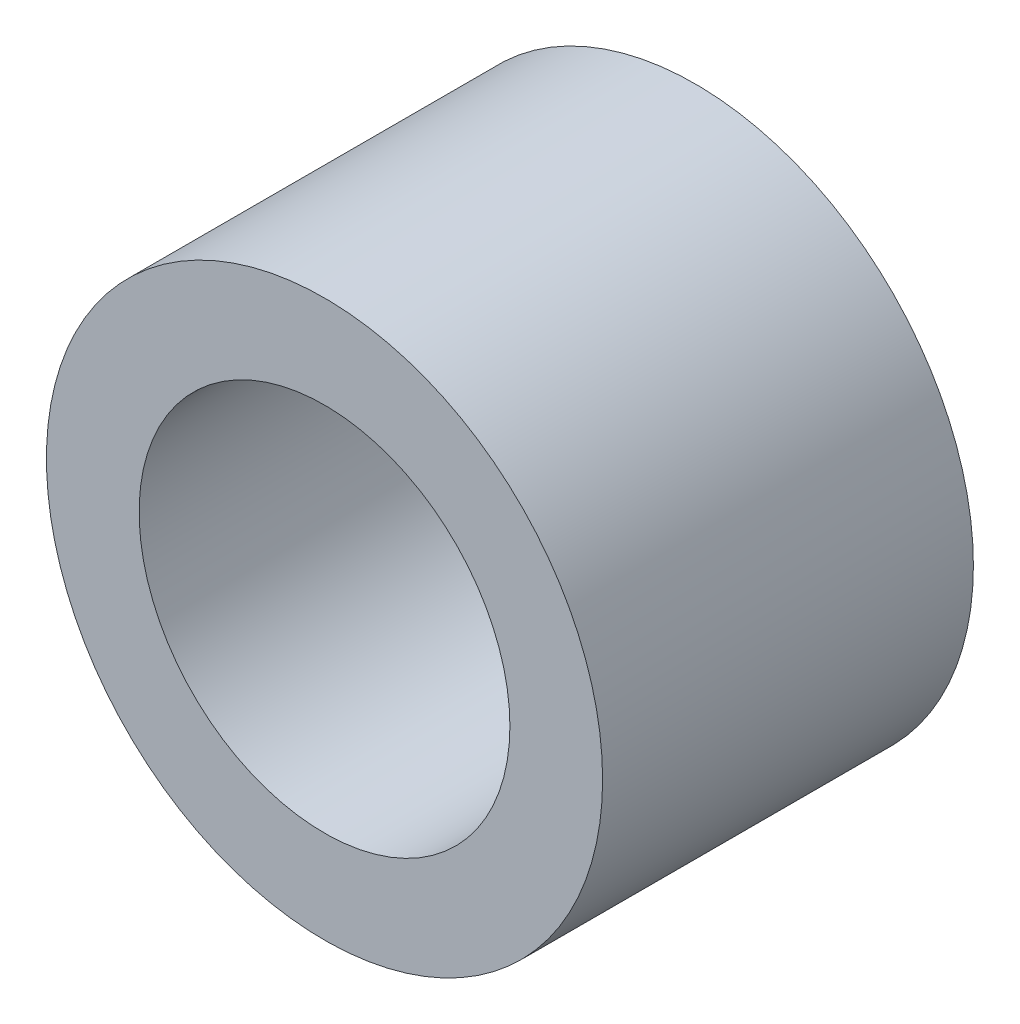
from build123d import *

# Parameters (mm, degrees)
ESQUISSE1_R          = 9
ESQUISSE1_R_2        = 6
BASE_EXTRUSION_DEPTH = 12


with BuildPart() as part:
    # Esquisse1 → Base-Extrusion (new body)
    with BuildSketch(Plane.XY):
        Circle(ESQUISSE1_R)
        Circle(ESQUISSE1_R_2, mode=Mode.SUBTRACT)
    extrude(amount=BASE_EXTRUSION_DEPTH)


solid = part.part
